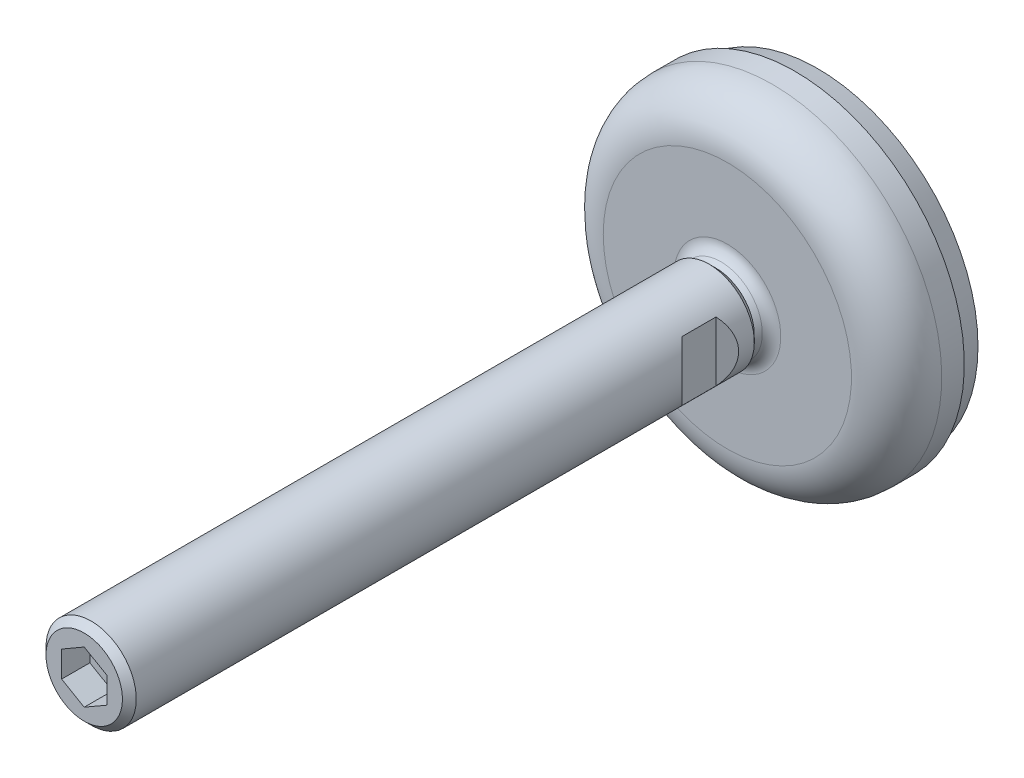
ISO-10303-21;
HEADER;
FILE_DESCRIPTION(('STEP AP214'),'2;1');
FILE_NAME('part.step','',(''),(''),'','','');
FILE_SCHEMA(('AUTOMOTIVE_DESIGN { 1 0 10303 214 1 1 1 1 }'));
ENDSEC;
DATA;
#1=APPLICATION_CONTEXT('core data for automotive mechanical design processes');
#2=APPLICATION_PROTOCOL_DEFINITION('international standard','automotive_design',2000,#1);
#3=PRODUCT_CONTEXT('',#1,'mechanical');
#4=PRODUCT('Part','Part','',(#3));
#5=PRODUCT_RELATED_PRODUCT_CATEGORY('part','',(#4));
#6=PRODUCT_DEFINITION_FORMATION('','',#4);
#7=PRODUCT_DEFINITION_CONTEXT('part definition',#1,'design');
#8=PRODUCT_DEFINITION('design','',#6,#7);
#9=PRODUCT_DEFINITION_SHAPE('','',#8);
#10=(LENGTH_UNIT() NAMED_UNIT(*) SI_UNIT(.MILLI.,.METRE.));
#11=(NAMED_UNIT(*) PLANE_ANGLE_UNIT() SI_UNIT($,.RADIAN.));
#12=(NAMED_UNIT(*) SI_UNIT($,.STERADIAN.) SOLID_ANGLE_UNIT());
#13=UNCERTAINTY_MEASURE_WITH_UNIT(LENGTH_MEASURE(1.E-05),#10,'distance_accuracy_value','');
#14=(GEOMETRIC_REPRESENTATION_CONTEXT(3) GLOBAL_UNCERTAINTY_ASSIGNED_CONTEXT((#13)) GLOBAL_UNIT_ASSIGNED_CONTEXT((#10,
#11,#12)) REPRESENTATION_CONTEXT('',''));
#15=CARTESIAN_POINT('',(0.,0.,0.));
#16=DIRECTION('',(0.,0.,1.));
#17=DIRECTION('',(1.,0.,0.));
#18=AXIS2_PLACEMENT_3D('',#15,#16,#17);
#19=CARTESIAN_POINT('',(0.,0.,19.227));
#20=DIRECTION('',(0.,0.,-1.));
#21=DIRECTION('',(-1.,0.,0.));
#22=AXIS2_PLACEMENT_3D('',#19,#20,#21);
#23=CYLINDRICAL_SURFACE('',#22,8.);
#24=DIRECTION('',(0.,0.,-1.));
#25=VECTOR('',#24,1.);
#26=CARTESIAN_POINT('',(6.,5.29150262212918,19.227));
#27=LINE('',#26,#25);
#28=CARTESIAN_POINT('',(6.,5.29150262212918,24.));
#29=VERTEX_POINT('',#28);
#30=CARTESIAN_POINT('',(6.,5.29150262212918,30.));
#31=VERTEX_POINT('',#30);
#32=EDGE_CURVE('E9',#29,#31,#27,.F.);
#33=ORIENTED_EDGE('',*,*,#32,.F.);
#34=CARTESIAN_POINT('',(0.,0.,30.));
#35=DIRECTION('',(-0.707106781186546,0.,-0.70710678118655));
#36=DIRECTION('',(0.70710678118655,0.,-0.707106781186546));
#37=AXIS2_PLACEMENT_3D('',#34,#35,#36);
#38=ELLIPSE('',#37,11.3137084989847,8.);
#39=CARTESIAN_POINT('',(6.,-5.29150262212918,24.));
#40=VERTEX_POINT('',#39);
#41=EDGE_CURVE('E215',#40,#29,#38,.F.);
#42=ORIENTED_EDGE('',*,*,#41,.F.);
#43=DIRECTION('',(0.,0.,-1.));
#44=VECTOR('',#43,1.);
#45=CARTESIAN_POINT('',(6.,-5.29150262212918,19.227));
#46=LINE('',#45,#44);
#47=CARTESIAN_POINT('',(6.,-5.29150262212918,30.));
#48=VERTEX_POINT('',#47);
#49=EDGE_CURVE('E217',#48,#40,#46,.T.);
#50=ORIENTED_EDGE('',*,*,#49,.F.);
#51=CARTESIAN_POINT('',(0.,0.,24.));
#52=DIRECTION('',(-0.707106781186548,0.,0.707106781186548));
#53=DIRECTION('',(-0.707106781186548,0.,-0.707106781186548));
#54=AXIS2_PLACEMENT_3D('',#51,#52,#53);
#55=ELLIPSE('',#54,11.3137084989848,8.);
#56=EDGE_CURVE('E22',#31,#48,#55,.F.);
#57=ORIENTED_EDGE('',*,*,#56,.F.);
#58=EDGE_LOOP('',(#33,#42,#50,#57));
#59=FACE_BOUND('',#58,.T.);
#60=DIRECTION('',(0.,0.,-1.));
#61=VECTOR('',#60,1.);
#62=CARTESIAN_POINT('',(-6.,-5.29150262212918,19.227));
#63=LINE('',#62,#61);
#64=CARTESIAN_POINT('',(-6.,-5.29150262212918,24.));
#65=VERTEX_POINT('',#64);
#66=CARTESIAN_POINT('',(-6.,-5.29150262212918,30.));
#67=VERTEX_POINT('',#66);
#68=EDGE_CURVE('E209',#65,#67,#63,.F.);
#69=ORIENTED_EDGE('',*,*,#68,.F.);
#70=CARTESIAN_POINT('',(0.,0.,30.));
#71=DIRECTION('',(0.707106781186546,0.,-0.70710678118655));
#72=DIRECTION('',(-0.70710678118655,0.,-0.707106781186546));
#73=AXIS2_PLACEMENT_3D('',#70,#71,#72);
#74=ELLIPSE('',#73,11.3137084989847,8.);
#75=CARTESIAN_POINT('',(-6.,5.29150262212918,24.));
#76=VERTEX_POINT('',#75);
#77=EDGE_CURVE('E212',#76,#65,#74,.F.);
#78=ORIENTED_EDGE('',*,*,#77,.F.);
#79=DIRECTION('',(0.,0.,-1.));
#80=VECTOR('',#79,1.);
#81=CARTESIAN_POINT('',(-6.,5.29150262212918,19.227));
#82=LINE('',#81,#80);
#83=CARTESIAN_POINT('',(-6.,5.29150262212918,30.));
#84=VERTEX_POINT('',#83);
#85=EDGE_CURVE('E186',#84,#76,#82,.T.);
#86=ORIENTED_EDGE('',*,*,#85,.F.);
#87=CARTESIAN_POINT('',(0.,0.,24.));
#88=DIRECTION('',(0.707106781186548,0.,0.707106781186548));
#89=DIRECTION('',(0.707106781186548,0.,-0.707106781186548));
#90=AXIS2_PLACEMENT_3D('',#87,#88,#89);
#91=ELLIPSE('',#90,11.3137084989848,8.);
#92=EDGE_CURVE('E183',#67,#84,#91,.F.);
#93=ORIENTED_EDGE('',*,*,#92,.F.);
#94=EDGE_LOOP('',(#69,#78,#86,#93));
#95=FACE_BOUND('',#94,.T.);
#96=CARTESIAN_POINT('',(0.,0.,128.773));
#97=DIRECTION('',(0.,0.,-1.));
#98=DIRECTION('',(0.,1.,0.));
#99=AXIS2_PLACEMENT_3D('',#96,#97,#98);
#100=CIRCLE('',#99,8.);
#101=CARTESIAN_POINT('',(0.,8.,128.773));
#102=VERTEX_POINT('',#101);
#103=EDGE_CURVE('E191',#102,#102,#100,.T.);
#104=ORIENTED_EDGE('',*,*,#103,.T.);
#105=EDGE_LOOP('',(#104));
#106=FACE_BOUND('',#105,.T.);
#107=CARTESIAN_POINT('',(0.,0.,19.227));
#108=DIRECTION('',(0.,0.,-1.));
#109=DIRECTION('',(0.,1.,0.));
#110=AXIS2_PLACEMENT_3D('',#107,#108,#109);
#111=CIRCLE('',#110,8.);
#112=CARTESIAN_POINT('',(0.,8.,19.227));
#113=VERTEX_POINT('',#112);
#114=EDGE_CURVE('E495',#113,#113,#111,.T.);
#115=ORIENTED_EDGE('',*,*,#114,.F.);
#116=EDGE_LOOP('',(#115));
#117=FACE_BOUND('',#116,.T.);
#118=ADVANCED_FACE('F14',(#59,#95,#106,#117),#23,.T.);
#119=CARTESIAN_POINT('',(0.,0.,18.));
#120=DIRECTION('',(0.,0.,1.));
#121=DIRECTION('',(1.,0.,0.));
#122=AXIS2_PLACEMENT_3D('',#119,#120,#121);
#123=CONICAL_SURFACE('',#122,6.773,0.785398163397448);
#124=ORIENTED_EDGE('',*,*,#114,.T.);
#125=EDGE_LOOP('',(#124));
#126=FACE_BOUND('',#125,.T.);
#127=CARTESIAN_POINT('',(0.,0.,18.));
#128=DIRECTION('',(0.,0.,-1.));
#129=DIRECTION('',(-1.,0.,0.));
#130=AXIS2_PLACEMENT_3D('',#127,#128,#129);
#131=CIRCLE('',#130,6.773);
#132=CARTESIAN_POINT('',(-6.773,0.,18.));
#133=VERTEX_POINT('',#132);
#134=EDGE_CURVE('E493',#133,#133,#131,.T.);
#135=ORIENTED_EDGE('',*,*,#134,.F.);
#136=EDGE_LOOP('',(#135));
#137=FACE_BOUND('',#136,.T.);
#138=ADVANCED_FACE('F388',(#126,#137),#123,.T.);
#139=CARTESIAN_POINT('',(1.93614044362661,0.,11.2805600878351));
#140=DIRECTION('',(0.,1.,0.));
#141=DIRECTION('',(-0.176012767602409,0.,-0.984387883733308));
#142=AXIS2_PLACEMENT_3D('',#139,#140,#141);
#143=CIRCLE('',#142,11.0000000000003);
#144=TRIMMED_CURVE('',#143,(PARAMETER_VALUE(0.)),(PARAMETER_VALUE(2.78772364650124)),.T.,.PARAMETER.);
#145=CARTESIAN_POINT('',(0.,0.,11.2805600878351));
#146=DIRECTION('',(0.,0.,-1.));
#147=AXIS1_PLACEMENT('',#145,#146);
#148=SURFACE_OF_REVOLUTION('',#144,#147);
#149=ORIENTED_EDGE('',*,*,#134,.T.);
#150=EDGE_LOOP('',(#149));
#151=FACE_BOUND('',#150,.T.);
#152=CARTESIAN_POINT('',(0.,0.,17.1630667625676));
#153=DIRECTION('',(0.,0.,-1.));
#154=DIRECTION('',(-1.,0.,0.));
#155=AXIS2_PLACEMENT_3D('',#152,#153,#154);
#156=CIRCLE('',#155,7.35881061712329);
#157=CARTESIAN_POINT('',(-7.35881061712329,0.,17.1630667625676));
#158=VERTEX_POINT('',#157);
#159=EDGE_CURVE('E203',#158,#158,#156,.T.);
#160=ORIENTED_EDGE('',*,*,#159,.F.);
#161=EDGE_LOOP('',(#160));
#162=FACE_BOUND('',#161,.T.);
#163=ADVANCED_FACE('F397',(#151,#162),#148,.F.);
#164=CARTESIAN_POINT('',(0.,0.,18.5));
#165=DIRECTION('',(0.,0.,-1.));
#166=DIRECTION('',(-1.,0.,0.));
#167=AXIS2_PLACEMENT_3D('',#164,#165,#166);
#168=TOROIDAL_SURFACE('',#167,9.4712995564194,2.5);
#169=CARTESIAN_POINT('',(0.,0.,16.));
#170=DIRECTION('',(0.,0.,-1.));
#171=DIRECTION('',(-1.,0.,0.));
#172=AXIS2_PLACEMENT_3D('',#169,#170,#171);
#173=CIRCLE('',#172,9.47129955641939);
#174=CARTESIAN_POINT('',(-9.47129955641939,0.,16.));
#175=VERTEX_POINT('',#174);
#176=EDGE_CURVE('E200',#175,#175,#173,.T.);
#177=ORIENTED_EDGE('',*,*,#176,.F.);
#178=EDGE_LOOP('',(#177));
#179=FACE_BOUND('',#178,.T.);
#180=ORIENTED_EDGE('',*,*,#159,.T.);
#181=EDGE_LOOP('',(#180));
#182=FACE_BOUND('',#181,.T.);
#183=ADVANCED_FACE('F407',(#179,#182),#168,.F.);
#184=CARTESIAN_POINT('',(-22.,22.,16.));
#185=CARTESIAN_POINT('',(-22.,-22.,16.));
#186=CARTESIAN_POINT('',(-22.,-22.44,16.));
#187=B_SPLINE_CURVE_WITH_KNOTS('',1,(#184,#185,#186),.UNSPECIFIED.,.F.,.F.,(2,1,2),(0.,1.,1.01),.UNSPECIFIED.);
#188=DIRECTION('',(1.,0.,0.));
#189=VECTOR('',#188,1.);
#190=SURFACE_OF_LINEAR_EXTRUSION('',#187,#189);
#191=ORIENTED_EDGE('',*,*,#176,.T.);
#192=EDGE_LOOP('',(#191));
#193=FACE_BOUND('',#192,.T.);
#194=CARTESIAN_POINT('',(0.,0.,16.));
#195=DIRECTION('',(0.,0.,-1.));
#196=DIRECTION('',(-1.,0.,0.));
#197=AXIS2_PLACEMENT_3D('',#194,#195,#196);
#198=CIRCLE('',#197,22.);
#199=CARTESIAN_POINT('',(-22.,0.,16.));
#200=VERTEX_POINT('',#199);
#201=EDGE_CURVE('E197',#200,#200,#198,.T.);
#202=ORIENTED_EDGE('',*,*,#201,.F.);
#203=EDGE_LOOP('',(#202));
#204=FACE_BOUND('',#203,.T.);
#205=ADVANCED_FACE('F415',(#193,#204),#190,.T.);
#206=CARTESIAN_POINT('',(0.,0.,8.));
#207=DIRECTION('',(0.,0.,-1.));
#208=DIRECTION('',(-1.,0.,0.));
#209=AXIS2_PLACEMENT_3D('',#206,#207,#208);
#210=TOROIDAL_SURFACE('',#209,22.,8.);
#211=ORIENTED_EDGE('',*,*,#201,.T.);
#212=EDGE_LOOP('',(#211));
#213=FACE_BOUND('',#212,.T.);
#214=CARTESIAN_POINT('',(0.,0.,8.));
#215=DIRECTION('',(0.,0.,-1.));
#216=DIRECTION('',(0.,1.,0.));
#217=AXIS2_PLACEMENT_3D('',#214,#215,#216);
#218=CIRCLE('',#217,30.);
#219=CARTESIAN_POINT('',(0.,30.,8.));
#220=VERTEX_POINT('',#219);
#221=EDGE_CURVE('E196',#220,#220,#218,.T.);
#222=ORIENTED_EDGE('',*,*,#221,.F.);
#223=EDGE_LOOP('',(#222));
#224=FACE_BOUND('',#223,.T.);
#225=ADVANCED_FACE('F420',(#213,#224),#210,.T.);
#226=CARTESIAN_POINT('',(0.,0.,4.));
#227=DIRECTION('',(0.,0.,-1.));
#228=DIRECTION('',(-1.,0.,0.));
#229=AXIS2_PLACEMENT_3D('',#226,#227,#228);
#230=CYLINDRICAL_SURFACE('',#229,30.);
#231=CARTESIAN_POINT('',(0.,0.,4.));
#232=DIRECTION('',(0.,0.,-1.));
#233=DIRECTION('',(-1.,0.,0.));
#234=AXIS2_PLACEMENT_3D('',#231,#232,#233);
#235=CIRCLE('',#234,30.);
#236=CARTESIAN_POINT('',(-30.,0.,4.));
#237=VERTEX_POINT('',#236);
#238=EDGE_CURVE('E188',#237,#237,#235,.T.);
#239=ORIENTED_EDGE('',*,*,#238,.F.);
#240=EDGE_LOOP('',(#239));
#241=FACE_BOUND('',#240,.T.);
#242=ORIENTED_EDGE('',*,*,#221,.T.);
#243=EDGE_LOOP('',(#242));
#244=FACE_BOUND('',#243,.T.);
#245=ADVANCED_FACE('F430',(#241,#244),#230,.T.);
#246=CARTESIAN_POINT('',(-30.3600010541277,-30.,4.));
#247=DIRECTION('',(0.,0.,-1.));
#248=DIRECTION('',(0.,1.,0.));
#249=AXIS2_PLACEMENT_3D('',#246,#247,#248);
#250=PLANE('',#249);
#251=CARTESIAN_POINT('',(0.,0.,4.));
#252=DIRECTION('',(0.,0.,1.));
#253=DIRECTION('',(1.,0.,0.));
#254=AXIS2_PLACEMENT_3D('',#251,#252,#253);
#255=CIRCLE('',#254,29.5);
#256=CARTESIAN_POINT('',(29.5,0.,4.));
#257=VERTEX_POINT('',#256);
#258=EDGE_CURVE('E179',#257,#257,#255,.F.);
#259=ORIENTED_EDGE('',*,*,#258,.F.);
#260=EDGE_LOOP('',(#259));
#261=FACE_BOUND('',#260,.T.);
#262=ORIENTED_EDGE('',*,*,#238,.T.);
#263=EDGE_LOOP('',(#262));
#264=FACE_BOUND('',#263,.T.);
#265=ADVANCED_FACE('F174',(#261,#264),#250,.T.);
#266=CARTESIAN_POINT('',(-28.7693427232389,-28.4282032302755,0.));
#267=DIRECTION('',(0.,0.,-1.));
#268=DIRECTION('',(0.,1.,0.));
#269=AXIS2_PLACEMENT_3D('',#266,#267,#268);
#270=PLANE('',#269);
#271=CARTESIAN_POINT('',(0.,0.,0.));
#272=DIRECTION('',(0.,0.,1.));
#273=DIRECTION('',(1.,0.,0.));
#274=AXIS2_PLACEMENT_3D('',#271,#272,#273);
#275=CIRCLE('',#274,28.4282032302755);
#276=CARTESIAN_POINT('',(28.4282032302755,0.,0.));
#277=VERTEX_POINT('',#276);
#278=EDGE_CURVE('E182',#277,#277,#275,.T.);
#279=ORIENTED_EDGE('',*,*,#278,.F.);
#280=EDGE_LOOP('',(#279));
#281=FACE_BOUND('',#280,.T.);
#282=ADVANCED_FACE('F165',(#281),#270,.T.);
#283=CARTESIAN_POINT('',(0.,0.,0.));
#284=DIRECTION('',(0.,0.,1.));
#285=DIRECTION('',(1.,0.,0.));
#286=AXIS2_PLACEMENT_3D('',#283,#284,#285);
#287=CONICAL_SURFACE('',#286,28.4282032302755,0.261799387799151);
#288=ORIENTED_EDGE('',*,*,#258,.T.);
#289=EDGE_LOOP('',(#288));
#290=FACE_BOUND('',#289,.T.);
#291=ORIENTED_EDGE('',*,*,#278,.T.);
#292=EDGE_LOOP('',(#291));
#293=FACE_BOUND('',#292,.T.);
#294=ADVANCED_FACE('F16',(#290,#293),#287,.T.);
#295=CARTESIAN_POINT('',(-4.,-4.67422777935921,125.));
#296=DIRECTION('',(0.,0.,1.));
#297=DIRECTION('',(1.,0.,0.));
#298=AXIS2_PLACEMENT_3D('',#295,#296,#297);
#299=PLANE('',#298);
#300=DIRECTION('',(0.866025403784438,0.5,0.));
#301=VECTOR('',#300,1.);
#302=CARTESIAN_POINT('',(-2.,3.46410161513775,125.));
#303=LINE('',#302,#301);
#304=CARTESIAN_POINT('',(-4.,2.3094010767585,125.));
#305=VERTEX_POINT('',#304);
#306=CARTESIAN_POINT('',(1.08254330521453E-07,4.61880209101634,125.));
#307=VERTEX_POINT('',#306);
#308=EDGE_CURVE('E138',#305,#307,#303,.T.);
#309=ORIENTED_EDGE('',*,*,#308,.F.);
#310=DIRECTION('',(0.,1.,0.));
#311=VECTOR('',#310,1.);
#312=CARTESIAN_POINT('',(-4.,0.,125.));
#313=LINE('',#312,#311);
#314=CARTESIAN_POINT('',(-4.,-2.3094010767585,125.));
#315=VERTEX_POINT('',#314);
#316=EDGE_CURVE('E72',#315,#305,#313,.T.);
#317=ORIENTED_EDGE('',*,*,#316,.F.);
#318=DIRECTION('',(-0.866025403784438,0.5,0.));
#319=VECTOR('',#318,1.);
#320=CARTESIAN_POINT('',(-2.,-3.46410161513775,125.));
#321=LINE('',#320,#319);
#322=CARTESIAN_POINT('',(-2.16508660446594E-07,-4.61880202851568,125.));
#323=VERTEX_POINT('',#322);
#324=EDGE_CURVE('E68',#323,#315,#321,.T.);
#325=ORIENTED_EDGE('',*,*,#324,.F.);
#326=DIRECTION('',(-0.866025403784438,-0.5,0.));
#327=VECTOR('',#326,1.);
#328=CARTESIAN_POINT('',(2.,-3.46410161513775,125.));
#329=LINE('',#328,#327);
#330=CARTESIAN_POINT('',(4.,-2.3094010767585,125.));
#331=VERTEX_POINT('',#330);
#332=EDGE_CURVE('E91',#331,#323,#329,.T.);
#333=ORIENTED_EDGE('',*,*,#332,.F.);
#334=DIRECTION('',(0.,-1.,0.));
#335=VECTOR('',#334,1.);
#336=CARTESIAN_POINT('',(4.,0.,125.));
#337=LINE('',#336,#335);
#338=CARTESIAN_POINT('',(4.,2.3094010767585,125.));
#339=VERTEX_POINT('',#338);
#340=EDGE_CURVE('E149',#339,#331,#337,.T.);
#341=ORIENTED_EDGE('',*,*,#340,.F.);
#342=DIRECTION('',(0.866025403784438,-0.5,0.));
#343=VECTOR('',#342,1.);
#344=CARTESIAN_POINT('',(2.,3.46410161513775,125.));
#345=LINE('',#344,#343);
#346=EDGE_CURVE('E142',#307,#339,#345,.T.);
#347=ORIENTED_EDGE('',*,*,#346,.F.);
#348=EDGE_LOOP('',(#309,#317,#325,#333,#341,#347));
#349=FACE_BOUND('',#348,.T.);
#350=ADVANCED_FACE('F164',(#349),#299,.T.);
#351=CARTESIAN_POINT('',(4.,2.3094010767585,130.));
#352=DIRECTION('',(-0.5,-0.866025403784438,0.));
#353=DIRECTION('',(-0.866025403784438,0.5,0.));
#354=AXIS2_PLACEMENT_3D('',#351,#352,#353);
#355=PLANE('',#354);
#356=ORIENTED_EDGE('',*,*,#346,.T.);
#357=DIRECTION('',(0.,0.,-1.));
#358=VECTOR('',#357,1.);
#359=CARTESIAN_POINT('',(4.,2.3094010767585,130.));
#360=LINE('',#359,#358);
#361=CARTESIAN_POINT('',(4.,2.3094010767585,130.));
#362=VERTEX_POINT('',#361);
#363=EDGE_CURVE('E146',#362,#339,#360,.T.);
#364=ORIENTED_EDGE('',*,*,#363,.F.);
#365=CARTESIAN_POINT('',(0.,4.61880215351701,130.));
#366=CARTESIAN_POINT('',(0.166666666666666,4.52257710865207,130.));
#367=CARTESIAN_POINT('',(0.333333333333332,4.42635206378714,130.));
#368=CARTESIAN_POINT('',(0.666666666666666,4.23390197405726,130.));
#369=CARTESIAN_POINT('',(0.833333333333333,4.13767692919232,130.));
#370=CARTESIAN_POINT('',(1.16666666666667,3.94522683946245,130.));
#371=CARTESIAN_POINT('',(1.33333333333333,3.84900179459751,130.));
#372=CARTESIAN_POINT('',(1.66666666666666,3.65655170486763,130.));
#373=CARTESIAN_POINT('',(1.83333333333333,3.56032666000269,130.));
#374=CARTESIAN_POINT('',(2.16666666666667,3.36787657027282,130.));
#375=CARTESIAN_POINT('',(2.33333333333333,3.27165152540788,130.));
#376=CARTESIAN_POINT('',(2.66666666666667,3.079201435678,130.));
#377=CARTESIAN_POINT('',(2.83333333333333,2.98297639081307,130.));
#378=CARTESIAN_POINT('',(3.16666666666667,2.79052630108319,130.));
#379=CARTESIAN_POINT('',(3.33333333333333,2.69430125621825,130.));
#380=CARTESIAN_POINT('',(3.66666666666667,2.50185116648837,130.));
#381=CARTESIAN_POINT('',(3.83333333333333,2.40562612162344,130.));
#382=CARTESIAN_POINT('',(4.,2.3094010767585,130.));
#383=B_SPLINE_CURVE_WITH_KNOTS('',3,(#365,#366,#367,#368,#369,#370,#371,#372,#373,#374,#375,
#376,#377,#378,#379,#380,#381,#382),.UNSPECIFIED.,.F.,.F.,(4,2,2,2,2,2,2,2,4),(0.,
0.577350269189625,1.15470053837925,1.73205080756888,2.3094010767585,2.88675134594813,
3.46410161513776,4.04145188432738,4.61880215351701),.UNSPECIFIED.);
#384=CARTESIAN_POINT('',(-6.2517199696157E-08,4.61880211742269,130.));
#385=VERTEX_POINT('',#384);
#386=EDGE_CURVE('E120',#385,#362,#383,.T.);
#387=ORIENTED_EDGE('',*,*,#386,.F.);
#388=DIRECTION('',(0.,0.,-1.));
#389=VECTOR('',#388,1.);
#390=CARTESIAN_POINT('',(0.,4.61880215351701,130.));
#391=LINE('',#390,#389);
#392=EDGE_CURVE('E135',#385,#307,#391,.T.);
#393=ORIENTED_EDGE('',*,*,#392,.T.);
#394=EDGE_LOOP('',(#356,#364,#387,#393));
#395=FACE_BOUND('',#394,.T.);
#396=ADVANCED_FACE('F144',(#395),#355,.T.);
#397=CARTESIAN_POINT('',(0.,4.61880215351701,130.));
#398=DIRECTION('',(0.5,-0.866025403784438,0.));
#399=DIRECTION('',(-0.866025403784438,-0.5,0.));
#400=AXIS2_PLACEMENT_3D('',#397,#398,#399);
#401=PLANE('',#400);
#402=ORIENTED_EDGE('',*,*,#308,.T.);
#403=ORIENTED_EDGE('',*,*,#392,.F.);
#404=CARTESIAN_POINT('',(-4.,2.3094010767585,130.));
#405=CARTESIAN_POINT('',(-3.83333333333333,2.40562612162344,130.));
#406=CARTESIAN_POINT('',(-3.66666666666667,2.50185116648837,130.));
#407=CARTESIAN_POINT('',(-3.33333333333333,2.69430125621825,130.));
#408=CARTESIAN_POINT('',(-3.16666666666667,2.79052630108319,130.));
#409=CARTESIAN_POINT('',(-2.83333333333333,2.98297639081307,130.));
#410=CARTESIAN_POINT('',(-2.66666666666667,3.079201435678,130.));
#411=CARTESIAN_POINT('',(-2.33333333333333,3.27165152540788,130.));
#412=CARTESIAN_POINT('',(-2.16666666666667,3.36787657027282,130.));
#413=CARTESIAN_POINT('',(-1.83333333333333,3.56032666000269,130.));
#414=CARTESIAN_POINT('',(-1.66666666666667,3.65655170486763,130.));
#415=CARTESIAN_POINT('',(-1.33333333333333,3.84900179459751,130.));
#416=CARTESIAN_POINT('',(-1.16666666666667,3.94522683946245,130.));
#417=CARTESIAN_POINT('',(-0.833333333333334,4.13767692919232,130.));
#418=CARTESIAN_POINT('',(-0.666666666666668,4.23390197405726,130.));
#419=CARTESIAN_POINT('',(-0.333333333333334,4.42635206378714,130.));
#420=CARTESIAN_POINT('',(-0.166666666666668,4.52257710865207,130.));
#421=CARTESIAN_POINT('',(0.,4.61880215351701,130.));
#422=B_SPLINE_CURVE_WITH_KNOTS('',3,(#404,#405,#406,#407,#408,#409,#410,#411,#412,#413,#414,
#415,#416,#417,#418,#419,#420,#421),.UNSPECIFIED.,.F.,.F.,(4,2,2,2,2,2,2,2,4),(0.,
0.577350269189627,1.15470053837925,1.73205080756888,2.3094010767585,2.88675134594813,
3.46410161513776,4.04145188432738,4.61880215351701),.UNSPECIFIED.);
#423=CARTESIAN_POINT('',(-4.,2.3094010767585,130.));
#424=VERTEX_POINT('',#423);
#425=EDGE_CURVE('E82',#424,#385,#422,.T.);
#426=ORIENTED_EDGE('',*,*,#425,.F.);
#427=DIRECTION('',(0.,0.,-1.));
#428=VECTOR('',#427,1.);
#429=CARTESIAN_POINT('',(-4.,2.3094010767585,130.));
#430=LINE('',#429,#428);
#431=EDGE_CURVE('E78',#424,#305,#430,.T.);
#432=ORIENTED_EDGE('',*,*,#431,.T.);
#433=EDGE_LOOP('',(#402,#403,#426,#432));
#434=FACE_BOUND('',#433,.T.);
#435=ADVANCED_FACE('F132',(#434),#401,.T.);
#436=CARTESIAN_POINT('',(-4.,2.3094010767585,130.));
#437=DIRECTION('',(1.,0.,0.));
#438=DIRECTION('',(0.,-1.,0.));
#439=AXIS2_PLACEMENT_3D('',#436,#437,#438);
#440=PLANE('',#439);
#441=ORIENTED_EDGE('',*,*,#316,.T.);
#442=ORIENTED_EDGE('',*,*,#431,.F.);
#443=DIRECTION('',(0.,1.,0.));
#444=VECTOR('',#443,1.);
#445=CARTESIAN_POINT('',(-4.,0.,130.));
#446=LINE('',#445,#444);
#447=CARTESIAN_POINT('',(-4.,-2.3094010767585,130.));
#448=VERTEX_POINT('',#447);
#449=EDGE_CURVE('E75',#448,#424,#446,.T.);
#450=ORIENTED_EDGE('',*,*,#449,.F.);
#451=DIRECTION('',(0.,0.,-1.));
#452=VECTOR('',#451,1.);
#453=CARTESIAN_POINT('',(-4.,-2.3094010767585,130.));
#454=LINE('',#453,#452);
#455=EDGE_CURVE('E59',#448,#315,#454,.T.);
#456=ORIENTED_EDGE('',*,*,#455,.T.);
#457=EDGE_LOOP('',(#441,#442,#450,#456));
#458=FACE_BOUND('',#457,.T.);
#459=ADVANCED_FACE('F76',(#458),#440,.T.);
#460=CARTESIAN_POINT('',(-4.,-2.3094010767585,130.));
#461=DIRECTION('',(0.5,0.866025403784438,0.));
#462=DIRECTION('',(0.866025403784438,-0.5,0.));
#463=AXIS2_PLACEMENT_3D('',#460,#461,#462);
#464=PLANE('',#463);
#465=ORIENTED_EDGE('',*,*,#324,.T.);
#466=ORIENTED_EDGE('',*,*,#455,.F.);
#467=CARTESIAN_POINT('',(0.,-4.61880215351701,130.));
#468=CARTESIAN_POINT('',(-0.166666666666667,-4.52257710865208,130.));
#469=CARTESIAN_POINT('',(-0.333333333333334,-4.42635206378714,130.));
#470=CARTESIAN_POINT('',(-0.666666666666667,-4.23390197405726,130.));
#471=CARTESIAN_POINT('',(-0.833333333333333,-4.13767692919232,130.));
#472=CARTESIAN_POINT('',(-1.16666666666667,-3.94522683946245,130.));
#473=CARTESIAN_POINT('',(-1.33333333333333,-3.84900179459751,130.));
#474=CARTESIAN_POINT('',(-1.66666666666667,-3.65655170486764,130.));
#475=CARTESIAN_POINT('',(-1.83333333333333,-3.5603266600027,130.));
#476=CARTESIAN_POINT('',(-2.16666666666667,-3.36787657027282,130.));
#477=CARTESIAN_POINT('',(-2.33333333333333,-3.27165152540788,130.));
#478=CARTESIAN_POINT('',(-2.66666666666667,-3.07920143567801,130.));
#479=CARTESIAN_POINT('',(-2.83333333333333,-2.98297639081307,130.));
#480=CARTESIAN_POINT('',(-3.16666666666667,-2.7905263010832,130.));
#481=CARTESIAN_POINT('',(-3.33333333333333,-2.69430125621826,130.));
#482=CARTESIAN_POINT('',(-3.66666666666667,-2.50185116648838,130.));
#483=CARTESIAN_POINT('',(-3.83333333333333,-2.40562612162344,130.));
#484=CARTESIAN_POINT('',(-4.,-2.30940107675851,130.));
#485=B_SPLINE_CURVE_WITH_KNOTS('',3,(#467,#468,#469,#470,#471,#472,#473,#474,#475,#476,#477,
#478,#479,#480,#481,#482,#483,#484),.UNSPECIFIED.,.F.,.F.,(4,2,2,2,2,2,2,2,4),(0.,
0.577350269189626,1.15470053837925,1.73205080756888,2.3094010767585,2.88675134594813,
3.46410161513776,4.04145188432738,4.61880215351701),.UNSPECIFIED.);
#486=CARTESIAN_POINT('',(-6.25172003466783E-08,-4.61880211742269,130.));
#487=VERTEX_POINT('',#486);
#488=EDGE_CURVE('E64',#487,#448,#485,.T.);
#489=ORIENTED_EDGE('',*,*,#488,.F.);
#490=DIRECTION('',(0.,0.,-1.));
#491=VECTOR('',#490,1.);
#492=CARTESIAN_POINT('',(0.,-4.61880215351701,130.));
#493=LINE('',#492,#491);
#494=EDGE_CURVE('E89',#323,#487,#493,.F.);
#495=ORIENTED_EDGE('',*,*,#494,.F.);
#496=EDGE_LOOP('',(#465,#466,#489,#495));
#497=FACE_BOUND('',#496,.T.);
#498=ADVANCED_FACE('F61',(#497),#464,.T.);
#499=CARTESIAN_POINT('',(0.,-4.61880215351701,130.));
#500=DIRECTION('',(-0.5,0.866025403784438,0.));
#501=DIRECTION('',(0.866025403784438,0.5,0.));
#502=AXIS2_PLACEMENT_3D('',#499,#500,#501);
#503=PLANE('',#502);
#504=ORIENTED_EDGE('',*,*,#332,.T.);
#505=ORIENTED_EDGE('',*,*,#494,.T.);
#506=CARTESIAN_POINT('',(4.,-2.30940107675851,130.));
#507=CARTESIAN_POINT('',(3.83333333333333,-2.40562612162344,130.));
#508=CARTESIAN_POINT('',(3.66666666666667,-2.50185116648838,130.));
#509=CARTESIAN_POINT('',(3.33333333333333,-2.69430125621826,130.));
#510=CARTESIAN_POINT('',(3.16666666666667,-2.7905263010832,130.));
#511=CARTESIAN_POINT('',(2.83333333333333,-2.98297639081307,130.));
#512=CARTESIAN_POINT('',(2.66666666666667,-3.07920143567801,130.));
#513=CARTESIAN_POINT('',(2.33333333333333,-3.27165152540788,130.));
#514=CARTESIAN_POINT('',(2.16666666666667,-3.36787657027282,130.));
#515=CARTESIAN_POINT('',(1.83333333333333,-3.5603266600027,130.));
#516=CARTESIAN_POINT('',(1.66666666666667,-3.65655170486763,130.));
#517=CARTESIAN_POINT('',(1.33333333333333,-3.84900179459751,130.));
#518=CARTESIAN_POINT('',(1.16666666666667,-3.94522683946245,130.));
#519=CARTESIAN_POINT('',(0.833333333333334,-4.13767692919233,130.));
#520=CARTESIAN_POINT('',(0.666666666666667,-4.23390197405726,130.));
#521=CARTESIAN_POINT('',(0.333333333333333,-4.42635206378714,130.));
#522=CARTESIAN_POINT('',(0.166666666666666,-4.52257710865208,130.));
#523=CARTESIAN_POINT('',(0.,-4.61880215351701,130.));
#524=B_SPLINE_CURVE_WITH_KNOTS('',3,(#506,#507,#508,#509,#510,#511,#512,#513,#514,#515,#516,
#517,#518,#519,#520,#521,#522,#523),.UNSPECIFIED.,.F.,.F.,(4,2,2,2,2,2,2,2,4),(0.,
0.577350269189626,1.15470053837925,1.73205080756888,2.3094010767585,2.88675134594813,
3.46410161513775,4.04145188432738,4.61880215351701),.UNSPECIFIED.);
#525=CARTESIAN_POINT('',(4.,-2.3094010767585,130.));
#526=VERTEX_POINT('',#525);
#527=EDGE_CURVE('E88',#526,#487,#524,.T.);
#528=ORIENTED_EDGE('',*,*,#527,.F.);
#529=DIRECTION('',(0.,0.,-1.));
#530=VECTOR('',#529,1.);
#531=CARTESIAN_POINT('',(4.,-2.3094010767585,130.));
#532=LINE('',#531,#530);
#533=EDGE_CURVE('E37',#526,#331,#532,.T.);
#534=ORIENTED_EDGE('',*,*,#533,.T.);
#535=EDGE_LOOP('',(#504,#505,#528,#534));
#536=FACE_BOUND('',#535,.T.);
#537=ADVANCED_FACE('F111',(#536),#503,.T.);
#538=CARTESIAN_POINT('',(4.,-2.3094010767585,130.));
#539=DIRECTION('',(-1.,0.,0.));
#540=DIRECTION('',(0.,1.,0.));
#541=AXIS2_PLACEMENT_3D('',#538,#539,#540);
#542=PLANE('',#541);
#543=ORIENTED_EDGE('',*,*,#340,.T.);
#544=ORIENTED_EDGE('',*,*,#533,.F.);
#545=DIRECTION('',(0.,-1.,0.));
#546=VECTOR('',#545,1.);
#547=CARTESIAN_POINT('',(4.,0.,130.));
#548=LINE('',#547,#546);
#549=EDGE_CURVE('E123',#362,#526,#548,.T.);
#550=ORIENTED_EDGE('',*,*,#549,.F.);
#551=ORIENTED_EDGE('',*,*,#363,.T.);
#552=EDGE_LOOP('',(#543,#544,#550,#551));
#553=FACE_BOUND('',#552,.T.);
#554=ADVANCED_FACE('F151',(#553),#542,.T.);
#555=CARTESIAN_POINT('',(-6.85427810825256,6.773,130.));
#556=DIRECTION('',(0.,0.,1.));
#557=DIRECTION('',(0.,-1.,0.));
#558=AXIS2_PLACEMENT_3D('',#555,#556,#557);
#559=PLANE('',#558);
#560=ORIENTED_EDGE('',*,*,#549,.T.);
#561=ORIENTED_EDGE('',*,*,#527,.T.);
#562=ORIENTED_EDGE('',*,*,#488,.T.);
#563=ORIENTED_EDGE('',*,*,#449,.T.);
#564=ORIENTED_EDGE('',*,*,#425,.T.);
#565=ORIENTED_EDGE('',*,*,#386,.T.);
#566=EDGE_LOOP('',(#560,#561,#562,#563,#564,#565));
#567=FACE_BOUND('',#566,.T.);
#568=CARTESIAN_POINT('',(0.,0.,130.));
#569=DIRECTION('',(0.,0.,-1.));
#570=DIRECTION('',(-1.,0.,0.));
#571=AXIS2_PLACEMENT_3D('',#568,#569,#570);
#572=CIRCLE('',#571,6.773);
#573=CARTESIAN_POINT('',(-6.773,0.,130.));
#574=VERTEX_POINT('',#573);
#575=EDGE_CURVE('E204',#574,#574,#572,.T.);
#576=ORIENTED_EDGE('',*,*,#575,.F.);
#577=EDGE_LOOP('',(#576));
#578=FACE_BOUND('',#577,.T.);
#579=ADVANCED_FACE('F86',(#567,#578),#559,.T.);
#580=CARTESIAN_POINT('',(0.,0.,130.));
#581=DIRECTION('',(0.,0.,-1.));
#582=DIRECTION('',(-1.,0.,0.));
#583=AXIS2_PLACEMENT_3D('',#580,#581,#582);
#584=CONICAL_SURFACE('',#583,6.773,0.785398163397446);
#585=ORIENTED_EDGE('',*,*,#103,.F.);
#586=EDGE_LOOP('',(#585));
#587=FACE_BOUND('',#586,.T.);
#588=ORIENTED_EDGE('',*,*,#575,.T.);
#589=EDGE_LOOP('',(#588));
#590=FACE_BOUND('',#589,.T.);
#591=ADVANCED_FACE('F160',(#587,#590),#584,.T.);
#592=CARTESIAN_POINT('',(-8.,-10.,22.));
#593=DIRECTION('',(0.707106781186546,0.,-0.70710678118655));
#594=DIRECTION('',(-0.70710678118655,0.,-0.707106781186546));
#595=AXIS2_PLACEMENT_3D('',#592,#593,#594);
#596=PLANE('',#595);
#597=ORIENTED_EDGE('',*,*,#77,.T.);
#598=DIRECTION('',(0.,1.,0.));
#599=VECTOR('',#598,1.);
#600=CARTESIAN_POINT('',(-6.,-10.,24.));
#601=LINE('',#600,#599);
#602=EDGE_CURVE('E242',#65,#76,#601,.T.);
#603=ORIENTED_EDGE('',*,*,#602,.T.);
#604=EDGE_LOOP('',(#597,#603));
#605=FACE_BOUND('',#604,.T.);
#606=ADVANCED_FACE('F286',(#605),#596,.F.);
#607=CARTESIAN_POINT('',(-6.,-10.,24.));
#608=DIRECTION('',(1.,0.,0.));
#609=DIRECTION('',(0.,0.,-1.));
#610=AXIS2_PLACEMENT_3D('',#607,#608,#609);
#611=PLANE('',#610);
#612=ORIENTED_EDGE('',*,*,#68,.T.);
#613=DIRECTION('',(0.,1.,0.));
#614=VECTOR('',#613,1.);
#615=CARTESIAN_POINT('',(-6.,-10.,30.));
#616=LINE('',#615,#614);
#617=EDGE_CURVE('E235',#67,#84,#616,.T.);
#618=ORIENTED_EDGE('',*,*,#617,.T.);
#619=ORIENTED_EDGE('',*,*,#85,.T.);
#620=ORIENTED_EDGE('',*,*,#602,.F.);
#621=EDGE_LOOP('',(#612,#618,#619,#620));
#622=FACE_BOUND('',#621,.T.);
#623=ADVANCED_FACE('F276',(#622),#611,.F.);
#624=CARTESIAN_POINT('',(-6.,-10.,30.));
#625=DIRECTION('',(0.707106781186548,0.,0.707106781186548));
#626=DIRECTION('',(0.707106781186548,0.,-0.707106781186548));
#627=AXIS2_PLACEMENT_3D('',#624,#625,#626);
#628=PLANE('',#627);
#629=ORIENTED_EDGE('',*,*,#617,.F.);
#630=ORIENTED_EDGE('',*,*,#92,.T.);
#631=EDGE_LOOP('',(#629,#630));
#632=FACE_BOUND('',#631,.T.);
#633=ADVANCED_FACE('F277',(#632),#628,.F.);
#634=CARTESIAN_POINT('',(6.,-10.,30.));
#635=DIRECTION('',(-0.707106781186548,0.,0.707106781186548));
#636=DIRECTION('',(0.707106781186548,0.,0.707106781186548));
#637=AXIS2_PLACEMENT_3D('',#634,#635,#636);
#638=PLANE('',#637);
#639=DIRECTION('',(0.,1.,0.));
#640=VECTOR('',#639,1.);
#641=CARTESIAN_POINT('',(6.,-10.,30.));
#642=LINE('',#641,#640);
#643=EDGE_CURVE('E226',#48,#31,#642,.T.);
#644=ORIENTED_EDGE('',*,*,#643,.T.);
#645=ORIENTED_EDGE('',*,*,#56,.T.);
#646=EDGE_LOOP('',(#644,#645));
#647=FACE_BOUND('',#646,.T.);
#648=ADVANCED_FACE('F224',(#647),#638,.F.);
#649=CARTESIAN_POINT('',(6.,-10.,24.));
#650=DIRECTION('',(-1.,0.,0.));
#651=DIRECTION('',(0.,0.,1.));
#652=AXIS2_PLACEMENT_3D('',#649,#650,#651);
#653=PLANE('',#652);
#654=ORIENTED_EDGE('',*,*,#32,.T.);
#655=ORIENTED_EDGE('',*,*,#643,.F.);
#656=ORIENTED_EDGE('',*,*,#49,.T.);
#657=DIRECTION('',(0.,1.,0.));
#658=VECTOR('',#657,1.);
#659=CARTESIAN_POINT('',(6.,-10.,24.));
#660=LINE('',#659,#658);
#661=EDGE_CURVE('E28',#40,#29,#660,.T.);
#662=ORIENTED_EDGE('',*,*,#661,.T.);
#663=EDGE_LOOP('',(#654,#655,#656,#662));
#664=FACE_BOUND('',#663,.T.);
#665=ADVANCED_FACE('F233',(#664),#653,.F.);
#666=CARTESIAN_POINT('',(8.,-10.,22.));
#667=DIRECTION('',(-0.707106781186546,0.,-0.70710678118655));
#668=DIRECTION('',(-0.70710678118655,0.,0.707106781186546));
#669=AXIS2_PLACEMENT_3D('',#666,#667,#668);
#670=PLANE('',#669);
#671=ORIENTED_EDGE('',*,*,#41,.T.);
#672=ORIENTED_EDGE('',*,*,#661,.F.);
#673=EDGE_LOOP('',(#671,#672));
#674=FACE_BOUND('',#673,.T.);
#675=ADVANCED_FACE('F238',(#674),#670,.F.);
#676=CLOSED_SHELL('',(#118,#138,#163,#183,#205,#225,#245,#265,#282,#294,#350,#396,#435,#459,
#498,#537,#554,#579,#591,#606,#623,#633,#648,#665,#675));
#677=MANIFOLD_SOLID_BREP('B1',#676);
#678=ADVANCED_BREP_SHAPE_REPRESENTATION('',(#18,#677),#14);
#679=SHAPE_DEFINITION_REPRESENTATION(#9,#678);
ENDSEC;
END-ISO-10303-21;
